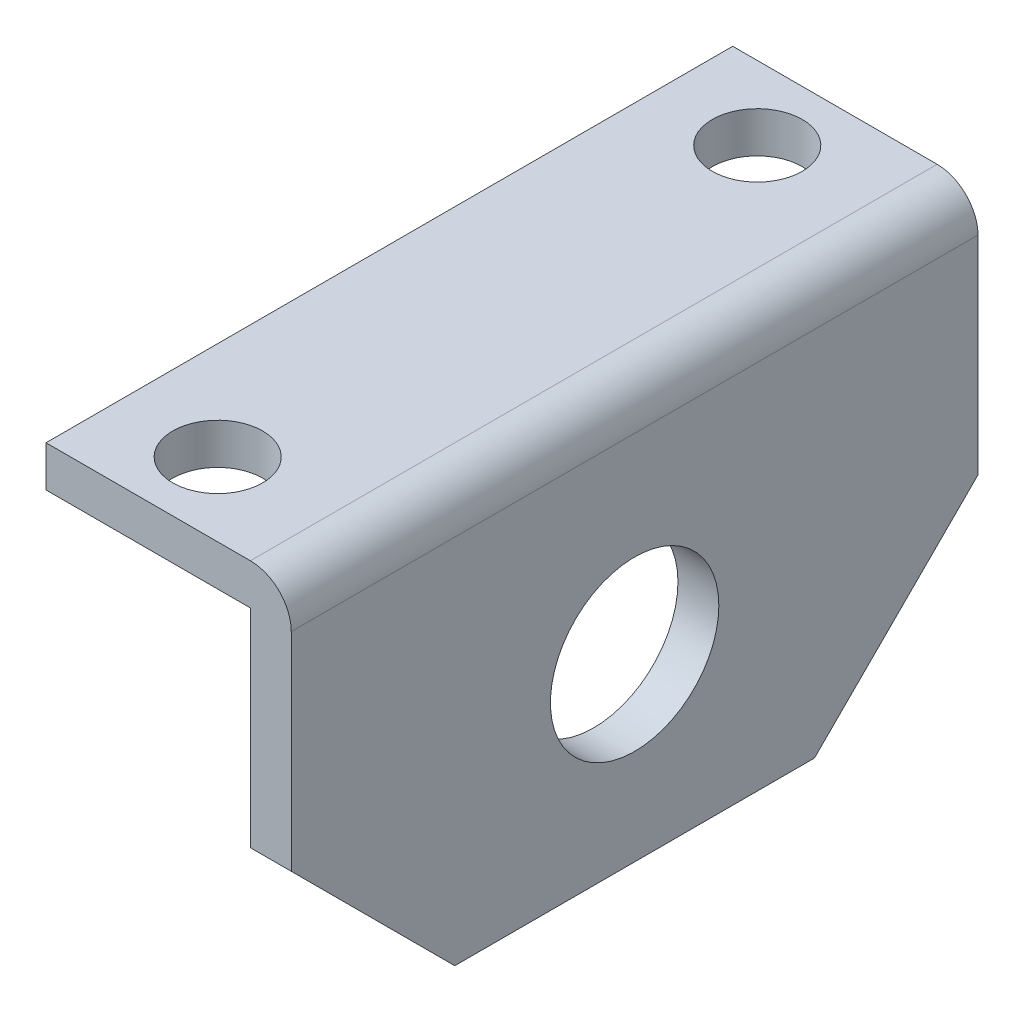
from build123d import *

# Parameters (mm, degrees)
EXTRUDE_1_DEPTH     = 42
SKETCH_2_R          = 2.75
CUT_EXTRUDE_1_DEPTH = 42
SKETCH_3_R          = 5.15
CUT_EXTRUDE_2_DEPTH = 42
CHAMFER_1_SIZE      = 10


with BuildPart() as part:
    # Sketch 1 → Extrude 1 (new body)
    with BuildSketch(Plane.XY):
        with BuildLine():
            Line((0, 0), (0, -2.5))
            Line((0, -2.5), (12.5, -2.5))
            Line((12.5, -2.5), (12.5, -25.2))
            Line((12.5, -25.2), (15, -25.2))
            Line((15, -25.2), (15, -2.5))
            ThreePointArc((15, -2.5), (14.267766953, -0.732233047), (12.5, 0))
            Line((12.5, 0), (0, 0))
        make_face()
    extrude(amount=EXTRUDE_1_DEPTH)

    # Sketch 2 → Cut-Extrude 1 (cut)
    with BuildSketch(Plane.XZ.offset(2.5)):
        with Locations(Location((6, 37.5, 0), (0, 0, 270))):
            Circle(SKETCH_2_R)
        with Locations(Location((6, 4.5, 0), (0, 0, 270))):
            Circle(SKETCH_2_R)
    extrude(amount=-CUT_EXTRUDE_1_DEPTH, mode=Mode.SUBTRACT)

    # Sketch 3 → Cut-Extrude 2 (cut)
    with BuildSketch(Plane(origin=(15, 0, 0), x_dir=(0, 0, -1), z_dir=(1, 0, 0))):
        with Locations((-21, -14.2)):
            Circle(SKETCH_3_R)
    extrude(amount=-CUT_EXTRUDE_2_DEPTH, mode=Mode.SUBTRACT)

    # Chamfer 1
    chamfer_1_edges = [part.edges().sort_by_distance(p)[0] for p in [
        (13.75, -25.2, 42),
        (13.75, -25.2, 0),
    ]]
    chamfer(chamfer_1_edges, length=CHAMFER_1_SIZE)


solid = part.part
